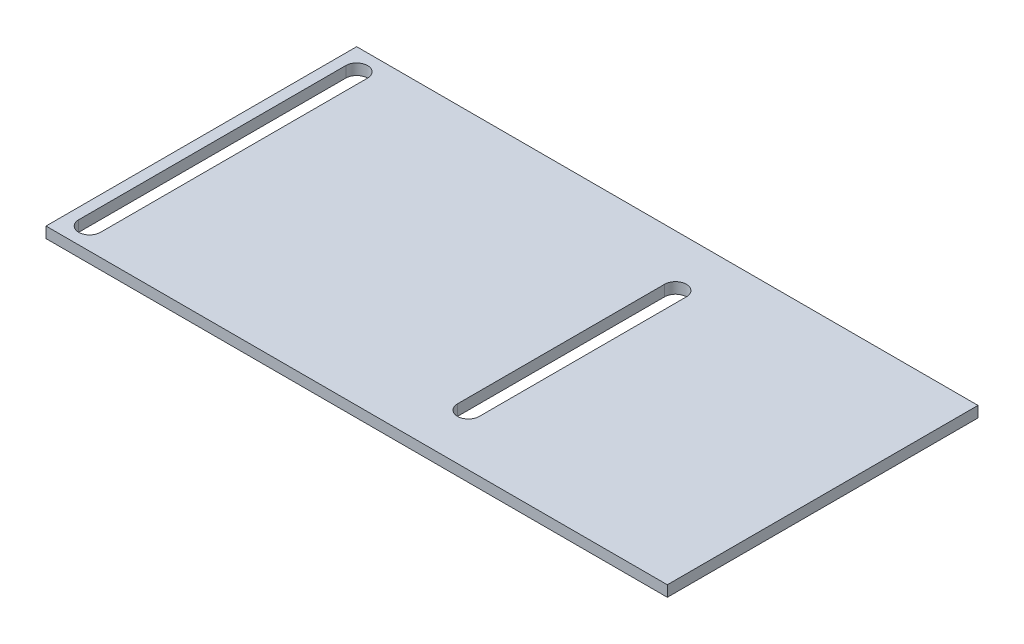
from build123d import *

# Parameters (mm, degrees)
SKETCH1_W           = 114
SKETCH1_H           = 57
BOSS_EXTRUDE1_DEPTH = 2
CUT_EXTRUDE1_DEPTH  = 2
CUT_EXTRUDE2_DEPTH  = 2


with BuildPart() as part:
    # Sketch1 → Boss-Extrude1 (new body)
    with BuildSketch(Plane(origin=(0, 0, 0), x_dir=(1, 0, 0), z_dir=(0, 1, 0))):
        Rectangle(SKETCH1_W, SKETCH1_H)
    extrude(amount=BOSS_EXTRUDE1_DEPTH)

    # Sketch2 → Cut-Extrude1 (cut)
    with BuildSketch(Plane(origin=(0, 2, 0), x_dir=(1, 0, 0), z_dir=(0, 1, 0))):
        with BuildLine():
            Line((-55, -24.5), (-55, 24.5))
            ThreePointArc((-55, 24.5), (-53, 26.5), (-51, 24.5))
            Line((-51, 24.5), (-51, -24.5))
            ThreePointArc((-51, -24.5), (-53, -26.5), (-55, -24.5))
        make_face()
    extrude(amount=-CUT_EXTRUDE1_DEPTH, mode=Mode.SUBTRACT)

    # Sketch3 → Cut-Extrude2 (cut)
    with BuildSketch(Plane(origin=(0, 2, 0), x_dir=(1, 0, 0), z_dir=(0, 1, 0))):
        with BuildLine():
            Line((13, 19), (13, -19))
            ThreePointArc((13, -19), (11, -21), (9, -19))
            Line((9, -19), (9, 19))
            ThreePointArc((9, 19), (11, 21), (13, 19))
        make_face()
    extrude(amount=-CUT_EXTRUDE2_DEPTH, mode=Mode.SUBTRACT)


solid = part.part
